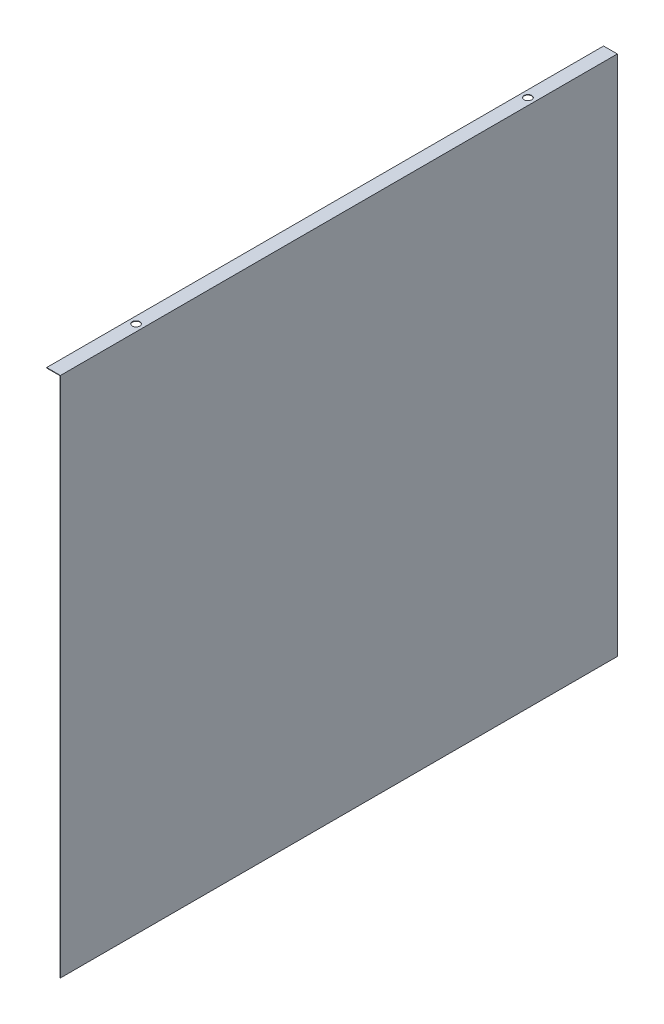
ISO-10303-21;
HEADER;
FILE_DESCRIPTION(('STEP AP214'),'2;1');
FILE_NAME('part.step','',(''),(''),'','','');
FILE_SCHEMA(('AUTOMOTIVE_DESIGN { 1 0 10303 214 1 1 1 1 }'));
ENDSEC;
DATA;
#1=APPLICATION_CONTEXT('core data for automotive mechanical design processes');
#2=APPLICATION_PROTOCOL_DEFINITION('international standard','automotive_design',2000,#1);
#3=PRODUCT_CONTEXT('',#1,'mechanical');
#4=PRODUCT('Part','Part','',(#3));
#5=PRODUCT_RELATED_PRODUCT_CATEGORY('part','',(#4));
#6=PRODUCT_DEFINITION_FORMATION('','',#4);
#7=PRODUCT_DEFINITION_CONTEXT('part definition',#1,'design');
#8=PRODUCT_DEFINITION('design','',#6,#7);
#9=PRODUCT_DEFINITION_SHAPE('','',#8);
#10=(LENGTH_UNIT() NAMED_UNIT(*) SI_UNIT(.MILLI.,.METRE.));
#11=(NAMED_UNIT(*) PLANE_ANGLE_UNIT() SI_UNIT($,.RADIAN.));
#12=(NAMED_UNIT(*) SI_UNIT($,.STERADIAN.) SOLID_ANGLE_UNIT());
#13=UNCERTAINTY_MEASURE_WITH_UNIT(LENGTH_MEASURE(1.E-05),#10,'distance_accuracy_value','');
#14=(GEOMETRIC_REPRESENTATION_CONTEXT(3) GLOBAL_UNCERTAINTY_ASSIGNED_CONTEXT((#13)) GLOBAL_UNIT_ASSIGNED_CONTEXT((#10,
#11,#12)) REPRESENTATION_CONTEXT('',''));
#15=CARTESIAN_POINT('',(0.,0.,0.));
#16=DIRECTION('',(0.,0.,1.));
#17=DIRECTION('',(1.,0.,0.));
#18=AXIS2_PLACEMENT_3D('',#15,#16,#17);
#19=CARTESIAN_POINT('',(0.,0.,810.));
#20=DIRECTION('',(0.,1.,0.));
#21=DIRECTION('',(0.,0.,1.));
#22=AXIS2_PLACEMENT_3D('',#19,#20,#21);
#23=PLANE('',#22);
#24=DIRECTION('',(1.,0.,0.));
#25=VECTOR('',#24,1.);
#26=CARTESIAN_POINT('',(0.,0.,0.));
#27=LINE('',#26,#25);
#28=CARTESIAN_POINT('',(-0.7,0.,0.));
#29=VERTEX_POINT('',#28);
#30=CARTESIAN_POINT('',(0.,0.,0.));
#31=VERTEX_POINT('',#30);
#32=EDGE_CURVE('E84',#29,#31,#27,.T.);
#33=ORIENTED_EDGE('',*,*,#32,.T.);
#34=DIRECTION('',(0.,0.,-1.));
#35=VECTOR('',#34,1.);
#36=CARTESIAN_POINT('',(0.,0.,810.));
#37=LINE('',#36,#35);
#38=CARTESIAN_POINT('',(0.,0.,810.));
#39=VERTEX_POINT('',#38);
#40=EDGE_CURVE('E11',#39,#31,#37,.T.);
#41=ORIENTED_EDGE('',*,*,#40,.F.);
#42=DIRECTION('',(1.,0.,0.));
#43=VECTOR('',#42,1.);
#44=CARTESIAN_POINT('',(0.,0.,810.));
#45=LINE('',#44,#43);
#46=CARTESIAN_POINT('',(-0.7,0.,810.));
#47=VERTEX_POINT('',#46);
#48=EDGE_CURVE('E112',#47,#39,#45,.T.);
#49=ORIENTED_EDGE('',*,*,#48,.F.);
#50=DIRECTION('',(0.,0.,-1.));
#51=VECTOR('',#50,1.);
#52=CARTESIAN_POINT('',(-0.7,0.,810.));
#53=LINE('',#52,#51);
#54=EDGE_CURVE('E97',#47,#29,#53,.T.);
#55=ORIENTED_EDGE('',*,*,#54,.T.);
#56=EDGE_LOOP('',(#33,#41,#49,#55));
#57=FACE_BOUND('',#56,.T.);
#58=ADVANCED_FACE('F26',(#57),#23,.F.);
#59=CARTESIAN_POINT('',(0.,0.,810.));
#60=DIRECTION('',(-1.,0.,0.));
#61=DIRECTION('',(0.,0.,1.));
#62=AXIS2_PLACEMENT_3D('',#59,#60,#61);
#63=PLANE('',#62);
#64=DIRECTION('',(0.,1.,0.));
#65=VECTOR('',#64,1.);
#66=CARTESIAN_POINT('',(0.,0.,0.));
#67=LINE('',#66,#65);
#68=CARTESIAN_POINT('',(0.,759.,0.));
#69=VERTEX_POINT('',#68);
#70=EDGE_CURVE('E80',#31,#69,#67,.T.);
#71=ORIENTED_EDGE('',*,*,#70,.T.);
#72=DIRECTION('',(0.,0.,-1.));
#73=VECTOR('',#72,1.);
#74=CARTESIAN_POINT('',(0.,759.,810.));
#75=LINE('',#74,#73);
#76=CARTESIAN_POINT('',(0.,759.,810.));
#77=VERTEX_POINT('',#76);
#78=EDGE_CURVE('E34',#77,#69,#75,.T.);
#79=ORIENTED_EDGE('',*,*,#78,.F.);
#80=DIRECTION('',(0.,1.,0.));
#81=VECTOR('',#80,1.);
#82=CARTESIAN_POINT('',(0.,0.,810.));
#83=LINE('',#82,#81);
#84=EDGE_CURVE('E93',#39,#77,#83,.T.);
#85=ORIENTED_EDGE('',*,*,#84,.F.);
#86=ORIENTED_EDGE('',*,*,#40,.T.);
#87=EDGE_LOOP('',(#71,#79,#85,#86));
#88=FACE_BOUND('',#87,.T.);
#89=ADVANCED_FACE('F92',(#88),#63,.F.);
#90=CARTESIAN_POINT('',(0.,759.,810.));
#91=DIRECTION('',(0.,-1.,0.));
#92=DIRECTION('',(0.,0.,-1.));
#93=AXIS2_PLACEMENT_3D('',#90,#91,#92);
#94=PLANE('',#93);
#95=CARTESIAN_POINT('',(-10.,759.,690.));
#96=DIRECTION('',(0.,1.,0.));
#97=DIRECTION('',(0.,0.,1.));
#98=AXIS2_PLACEMENT_3D('',#95,#96,#97);
#99=CIRCLE('',#98,5.5);
#100=CARTESIAN_POINT('',(-10.,759.,695.5));
#101=VERTEX_POINT('',#100);
#102=EDGE_CURVE('E207',#101,#101,#99,.T.);
#103=ORIENTED_EDGE('',*,*,#102,.F.);
#104=EDGE_LOOP('',(#103));
#105=FACE_BOUND('',#104,.T.);
#106=CARTESIAN_POINT('',(-10.,759.,120.));
#107=DIRECTION('',(0.,1.,0.));
#108=DIRECTION('',(0.,0.,1.));
#109=AXIS2_PLACEMENT_3D('',#106,#107,#108);
#110=CIRCLE('',#109,5.5);
#111=CARTESIAN_POINT('',(-10.,759.,125.5));
#112=VERTEX_POINT('',#111);
#113=EDGE_CURVE('E101',#112,#112,#110,.T.);
#114=ORIENTED_EDGE('',*,*,#113,.F.);
#115=EDGE_LOOP('',(#114));
#116=FACE_BOUND('',#115,.T.);
#117=DIRECTION('',(-1.,0.,0.));
#118=VECTOR('',#117,1.);
#119=CARTESIAN_POINT('',(0.,759.,0.));
#120=LINE('',#119,#118);
#121=CARTESIAN_POINT('',(-20.,759.,0.));
#122=VERTEX_POINT('',#121);
#123=EDGE_CURVE('E86',#69,#122,#120,.T.);
#124=ORIENTED_EDGE('',*,*,#123,.T.);
#125=DIRECTION('',(0.,0.,-1.));
#126=VECTOR('',#125,1.);
#127=CARTESIAN_POINT('',(-20.,759.,810.));
#128=LINE('',#127,#126);
#129=CARTESIAN_POINT('',(-20.,759.,810.));
#130=VERTEX_POINT('',#129);
#131=EDGE_CURVE('E128',#130,#122,#128,.T.);
#132=ORIENTED_EDGE('',*,*,#131,.F.);
#133=DIRECTION('',(-1.,0.,0.));
#134=VECTOR('',#133,1.);
#135=CARTESIAN_POINT('',(0.,759.,810.));
#136=LINE('',#135,#134);
#137=EDGE_CURVE('E115',#77,#130,#136,.T.);
#138=ORIENTED_EDGE('',*,*,#137,.F.);
#139=ORIENTED_EDGE('',*,*,#78,.T.);
#140=EDGE_LOOP('',(#124,#132,#138,#139));
#141=FACE_BOUND('',#140,.T.);
#142=ADVANCED_FACE('F133',(#105,#116,#141),#94,.F.);
#143=CARTESIAN_POINT('',(-20.,759.,810.));
#144=DIRECTION('',(1.,0.,0.));
#145=DIRECTION('',(0.,0.,-1.));
#146=AXIS2_PLACEMENT_3D('',#143,#144,#145);
#147=PLANE('',#146);
#148=DIRECTION('',(0.,-1.,0.));
#149=VECTOR('',#148,1.);
#150=CARTESIAN_POINT('',(-20.,759.,0.));
#151=LINE('',#150,#149);
#152=CARTESIAN_POINT('',(-20.,758.3,0.));
#153=VERTEX_POINT('',#152);
#154=EDGE_CURVE('E106',#122,#153,#151,.T.);
#155=ORIENTED_EDGE('',*,*,#154,.T.);
#156=DIRECTION('',(0.,0.,-1.));
#157=VECTOR('',#156,1.);
#158=CARTESIAN_POINT('',(-20.,758.3,810.));
#159=LINE('',#158,#157);
#160=CARTESIAN_POINT('',(-20.,758.3,810.));
#161=VERTEX_POINT('',#160);
#162=EDGE_CURVE('E125',#161,#153,#159,.T.);
#163=ORIENTED_EDGE('',*,*,#162,.F.);
#164=DIRECTION('',(0.,-1.,0.));
#165=VECTOR('',#164,1.);
#166=CARTESIAN_POINT('',(-20.,759.,810.));
#167=LINE('',#166,#165);
#168=EDGE_CURVE('E117',#130,#161,#167,.T.);
#169=ORIENTED_EDGE('',*,*,#168,.F.);
#170=ORIENTED_EDGE('',*,*,#131,.T.);
#171=EDGE_LOOP('',(#155,#163,#169,#170));
#172=FACE_BOUND('',#171,.T.);
#173=ADVANCED_FACE('F139',(#172),#147,.F.);
#174=CARTESIAN_POINT('',(-0.7,758.3,810.));
#175=DIRECTION('',(0.,1.,0.));
#176=DIRECTION('',(0.,0.,1.));
#177=AXIS2_PLACEMENT_3D('',#174,#175,#176);
#178=PLANE('',#177);
#179=CARTESIAN_POINT('',(-10.,758.3,690.));
#180=DIRECTION('',(0.,1.,0.));
#181=DIRECTION('',(0.,0.,1.));
#182=AXIS2_PLACEMENT_3D('',#179,#180,#181);
#183=CIRCLE('',#182,5.5);
#184=CARTESIAN_POINT('',(-10.,758.3,695.5));
#185=VERTEX_POINT('',#184);
#186=EDGE_CURVE('E29',#185,#185,#183,.T.);
#187=ORIENTED_EDGE('',*,*,#186,.T.);
#188=EDGE_LOOP('',(#187));
#189=FACE_BOUND('',#188,.T.);
#190=CARTESIAN_POINT('',(-10.,758.3,120.));
#191=DIRECTION('',(0.,1.,0.));
#192=DIRECTION('',(0.,0.,1.));
#193=AXIS2_PLACEMENT_3D('',#190,#191,#192);
#194=CIRCLE('',#193,5.5);
#195=CARTESIAN_POINT('',(-10.,758.3,125.5));
#196=VERTEX_POINT('',#195);
#197=EDGE_CURVE('E98',#196,#196,#194,.T.);
#198=ORIENTED_EDGE('',*,*,#197,.T.);
#199=EDGE_LOOP('',(#198));
#200=FACE_BOUND('',#199,.T.);
#201=DIRECTION('',(1.,0.,0.));
#202=VECTOR('',#201,1.);
#203=CARTESIAN_POINT('',(-0.7,758.3,0.));
#204=LINE('',#203,#202);
#205=CARTESIAN_POINT('',(-0.7,758.3,0.));
#206=VERTEX_POINT('',#205);
#207=EDGE_CURVE('E108',#153,#206,#204,.T.);
#208=ORIENTED_EDGE('',*,*,#207,.T.);
#209=DIRECTION('',(0.,0.,-1.));
#210=VECTOR('',#209,1.);
#211=CARTESIAN_POINT('',(-0.7,758.3,810.));
#212=LINE('',#211,#210);
#213=CARTESIAN_POINT('',(-0.7,758.3,810.));
#214=VERTEX_POINT('',#213);
#215=EDGE_CURVE('E122',#214,#206,#212,.T.);
#216=ORIENTED_EDGE('',*,*,#215,.F.);
#217=DIRECTION('',(1.,0.,0.));
#218=VECTOR('',#217,1.);
#219=CARTESIAN_POINT('',(-0.7,758.3,810.));
#220=LINE('',#219,#218);
#221=EDGE_CURVE('E47',#161,#214,#220,.T.);
#222=ORIENTED_EDGE('',*,*,#221,.F.);
#223=ORIENTED_EDGE('',*,*,#162,.T.);
#224=EDGE_LOOP('',(#208,#216,#222,#223));
#225=FACE_BOUND('',#224,.T.);
#226=ADVANCED_FACE('F142',(#189,#200,#225),#178,.F.);
#227=CARTESIAN_POINT('',(-0.7,0.,810.));
#228=DIRECTION('',(1.,0.,0.));
#229=DIRECTION('',(0.,0.,-1.));
#230=AXIS2_PLACEMENT_3D('',#227,#228,#229);
#231=PLANE('',#230);
#232=DIRECTION('',(0.,-1.,0.));
#233=VECTOR('',#232,1.);
#234=CARTESIAN_POINT('',(-0.7,0.,0.));
#235=LINE('',#234,#233);
#236=EDGE_CURVE('E110',#206,#29,#235,.T.);
#237=ORIENTED_EDGE('',*,*,#236,.T.);
#238=ORIENTED_EDGE('',*,*,#54,.F.);
#239=DIRECTION('',(0.,-1.,0.));
#240=VECTOR('',#239,1.);
#241=CARTESIAN_POINT('',(-0.7,0.,810.));
#242=LINE('',#241,#240);
#243=EDGE_CURVE('E42',#214,#47,#242,.T.);
#244=ORIENTED_EDGE('',*,*,#243,.F.);
#245=ORIENTED_EDGE('',*,*,#215,.T.);
#246=EDGE_LOOP('',(#237,#238,#244,#245));
#247=FACE_BOUND('',#246,.T.);
#248=ADVANCED_FACE('F144',(#247),#231,.F.);
#249=CARTESIAN_POINT('',(-0.7,0.,810.));
#250=DIRECTION('',(0.,0.,-1.));
#251=DIRECTION('',(-1.,0.,0.));
#252=AXIS2_PLACEMENT_3D('',#249,#250,#251);
#253=PLANE('',#252);
#254=ORIENTED_EDGE('',*,*,#48,.T.);
#255=ORIENTED_EDGE('',*,*,#84,.T.);
#256=ORIENTED_EDGE('',*,*,#137,.T.);
#257=ORIENTED_EDGE('',*,*,#168,.T.);
#258=ORIENTED_EDGE('',*,*,#221,.T.);
#259=ORIENTED_EDGE('',*,*,#243,.T.);
#260=EDGE_LOOP('',(#254,#255,#256,#257,#258,#259));
#261=FACE_BOUND('',#260,.T.);
#262=ADVANCED_FACE('F136',(#261),#253,.F.);
#263=CARTESIAN_POINT('',(-0.7,0.,0.));
#264=DIRECTION('',(0.,0.,-1.));
#265=DIRECTION('',(-1.,0.,0.));
#266=AXIS2_PLACEMENT_3D('',#263,#264,#265);
#267=PLANE('',#266);
#268=ORIENTED_EDGE('',*,*,#32,.F.);
#269=ORIENTED_EDGE('',*,*,#236,.F.);
#270=ORIENTED_EDGE('',*,*,#207,.F.);
#271=ORIENTED_EDGE('',*,*,#154,.F.);
#272=ORIENTED_EDGE('',*,*,#123,.F.);
#273=ORIENTED_EDGE('',*,*,#70,.F.);
#274=EDGE_LOOP('',(#268,#269,#270,#271,#272,#273));
#275=FACE_BOUND('',#274,.T.);
#276=ADVANCED_FACE('F81',(#275),#267,.T.);
#277=CARTESIAN_POINT('',(-10.,749.,120.));
#278=DIRECTION('',(0.,1.,0.));
#279=DIRECTION('',(0.,0.,1.));
#280=AXIS2_PLACEMENT_3D('',#277,#278,#279);
#281=CYLINDRICAL_SURFACE('',#280,5.5);
#282=ORIENTED_EDGE('',*,*,#113,.T.);
#283=EDGE_LOOP('',(#282));
#284=FACE_BOUND('',#283,.T.);
#285=ORIENTED_EDGE('',*,*,#197,.F.);
#286=EDGE_LOOP('',(#285));
#287=FACE_BOUND('',#286,.T.);
#288=ADVANCED_FACE('F188',(#284,#287),#281,.F.);
#289=CARTESIAN_POINT('',(-10.,749.,690.));
#290=DIRECTION('',(0.,1.,0.));
#291=DIRECTION('',(0.,0.,1.));
#292=AXIS2_PLACEMENT_3D('',#289,#290,#291);
#293=CYLINDRICAL_SURFACE('',#292,5.5);
#294=ORIENTED_EDGE('',*,*,#102,.T.);
#295=EDGE_LOOP('',(#294));
#296=FACE_BOUND('',#295,.T.);
#297=ORIENTED_EDGE('',*,*,#186,.F.);
#298=EDGE_LOOP('',(#297));
#299=FACE_BOUND('',#298,.T.);
#300=ADVANCED_FACE('F194',(#296,#299),#293,.F.);
#301=CLOSED_SHELL('',(#58,#89,#142,#173,#226,#248,#262,#276,#288,#300));
#302=MANIFOLD_SOLID_BREP('B2',#301);
#303=ADVANCED_BREP_SHAPE_REPRESENTATION('',(#18,#302),#14);
#304=SHAPE_DEFINITION_REPRESENTATION(#9,#303);
ENDSEC;
END-ISO-10303-21;
